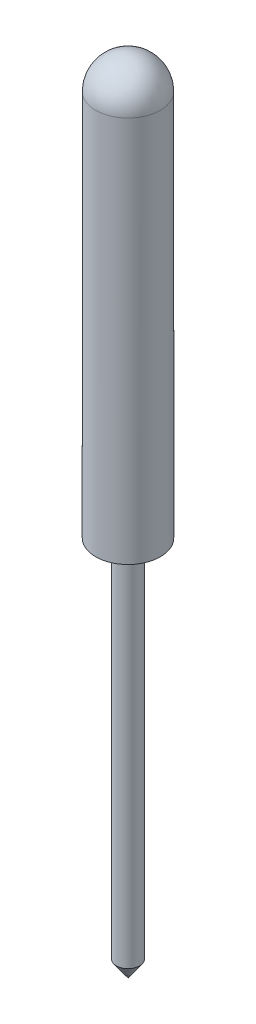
from build123d import *

# Parameters (mm, degrees)
SKETCH1_R           = 1.524
BOSS_EXTRUDE1_DEPTH = 50
SKETCH2_R           = 4.25
BOSS_EXTRUDE2_DEPTH = 50.75
DOME1_FACE_RADIUS   = 4.25
DOME1_HEIGHT        = 4.25


with BuildPart() as part:
    # Sketch1 → Boss-Extrude1 (new body)
    with BuildSketch(Plane(origin=(0, 0, 0), x_dir=(1, 0, 0), z_dir=(0, 1, 0))):
        with Locations(Location((0, 0, 0), (0, 0, 270))):
            Circle(SKETCH1_R)
    extrude(amount=BOSS_EXTRUDE1_DEPTH)

    # Sketch2 → Boss-Extrude2 (add)
    with BuildSketch(Plane(origin=(0, 50, 0), x_dir=(1, 0, 0), z_dir=(0, 1, 0))):
        with Locations(Location((0, 0, 0), (0, 0, 90))):
            Circle(SKETCH2_R)
    extrude(amount=BOSS_EXTRUDE2_DEPTH)

    # Dome1: a dome of height H over a round flat face of radius A is a cap of a sphere of radius (A * A + H * H) / (2 * H)
    dome1_r = (DOME1_FACE_RADIUS * DOME1_FACE_RADIUS + DOME1_HEIGHT * DOME1_HEIGHT) / (2 * DOME1_HEIGHT)
    dome1_base = Plane((0, 100.75, 0), z_dir=(0, 1, 0))
    with Locations(dome1_base.offset(DOME1_HEIGHT - dome1_r)):
        dome1_ball = Sphere(dome1_r, mode=Mode.PRIVATE)
    add(split(dome1_ball, bisect_by=dome1_base, keep=Keep.TOP, mode=Mode.PRIVATE))

    # Sketch3 → Cut-Revolve1 (revolve, cut)
    with BuildSketch(Plane.XY, mode=Mode.PRIVATE) as cut_revolve1_sk:
        Polygon((-2.187250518, 3.068659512), (0, 0), (0, -1.662647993), (-2.187250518, -1.662647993), align=None)
    revolve(cut_revolve1_sk.sketch.rotate(Axis((0, -1.662647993, 0), (0, 1, 0)), 90), axis=Axis((0, -1.662647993, 0), (0, 1, 0)), mode=Mode.SUBTRACT)


solid = part.part
